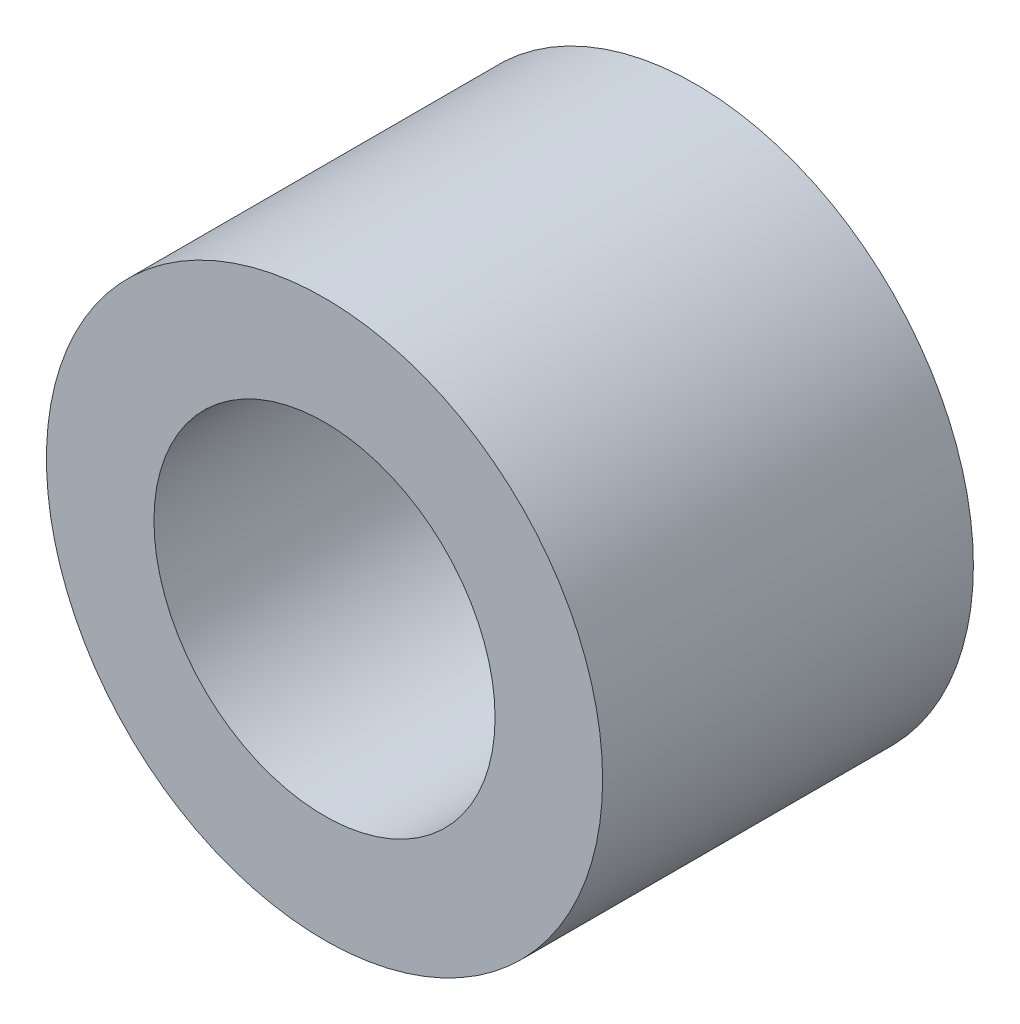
from build123d import *

# Parameters (mm, degrees)
EXTRUDE1_DEPTH      = 1.5875
EXTRUDE1_DEPTH_BACK = 1.5875
SKETCH1_R           = 2.38125
SKETCH1_R_2         = 1.4605


with BuildPart() as part:
    # Sketch1 → Extrude1 (new, two sides: drawn at the far end of the back side and taken through both)
    with BuildSketch(Plane.XY.offset(-EXTRUDE1_DEPTH_BACK)):
        Circle(SKETCH1_R)
        Circle(SKETCH1_R_2, mode=Mode.SUBTRACT)
    extrude(amount=EXTRUDE1_DEPTH + EXTRUDE1_DEPTH_BACK)


solid = part.part
